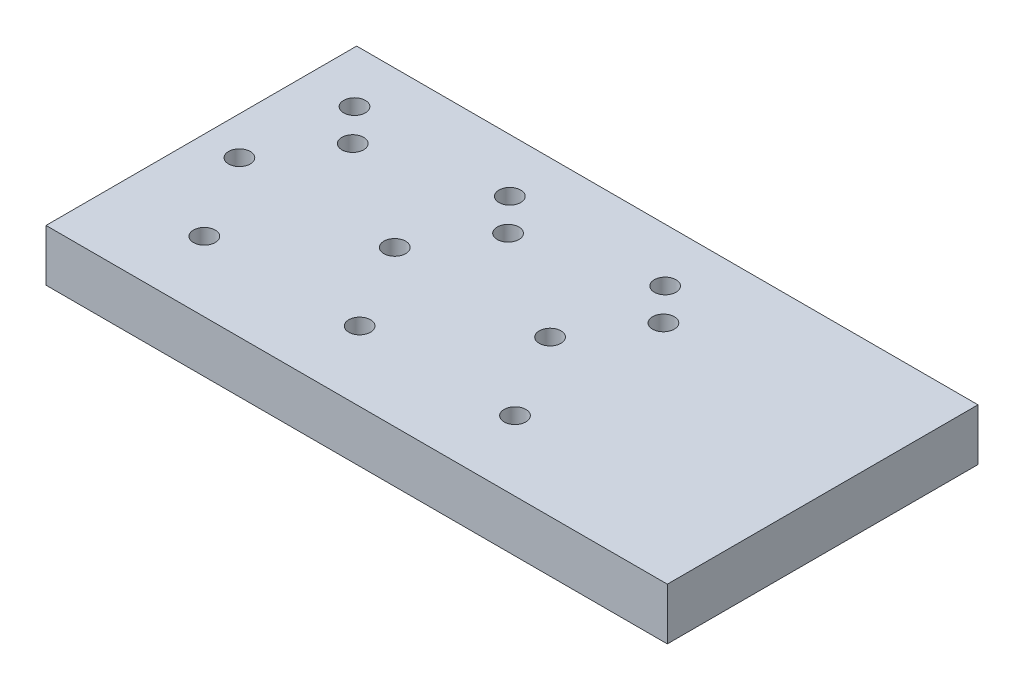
from build123d import *

# Parameters (mm, degrees)
SKIZZE1_W                     = 120
SKIZZE1_H                     = 60
LINEAR_AUSTRAGEN1_DEPTH       = 10
M5_GEWINDEBOHRUNG1_AT_2_COUNT = 2
M5_GEWINDEBOHRUNG1_AT_2_PITCH = 19.195077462
M5_GEWINDEBOHRUNG1_AT_3_COUNT = 2
M5_GEWINDEBOHRUNG1_AT_3_PITCH = 29.867760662
M5_GEWINDEBOHRUNG1_AT_4_COUNT = 2
M5_GEWINDEBOHRUNG1_AT_4_PITCH = 36.900091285
LINEARES_MUSTER1_COUNT        = 3
LINEARES_MUSTER1_PITCH        = 30


with BuildPart() as part:
    # Skizze1 → Linear austragen1 (new body)
    with BuildSketch(Plane(origin=(0, 0, 0), x_dir=(1, 0, 0), z_dir=(0, 1, 0))):
        Rectangle(SKIZZE1_W, SKIZZE1_H)
    extrude(amount=LINEAR_AUSTRAGEN1_DEPTH)

    # Skizze2 → M5 Gewindebohrung1 (revolve, cut)
    with BuildSketch(Plane(origin=(-42.891313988, 10, 16.53171986), x_dir=(0, 0, 1), z_dir=(1, 0, 0))):
        Polygon((0, 0), (0, 15.2618073), (2.1, 14), (2.1, 0), align=None)
    m5_gewindebohrung1 = revolve(axis=Axis((-42.891313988, 16.35, 16.53171986), (0, -1, 0)), mode=Mode.SUBTRACT)

    # M5 Gewindebohrung1 at 2: M5 Gewindebohrung1 ×2
    with Locations(*[Vector(-0.5081850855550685, 0, -0.8612478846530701) * (i * M5_GEWINDEBOHRUNG1_AT_2_PITCH) for i in range(1, M5_GEWINDEBOHRUNG1_AT_2_COUNT)]):
        add(m5_gewindebohrung1, mode=Mode.SUBTRACT)

    # M5 Gewindebohrung1 at 3: M5 Gewindebohrung1 ×2
    with Locations(*[Vector(-0.03944395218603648, 0, -0.9992217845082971) * (i * M5_GEWINDEBOHRUNG1_AT_3_PITCH) for i in range(1, M5_GEWINDEBOHRUNG1_AT_3_COUNT)]):
        add(m5_gewindebohrung1, mode=Mode.SUBTRACT)

    # M5 Gewindebohrung1 at 4: M5 Gewindebohrung1 ×2
    with Locations(*[Vector(-0.19484865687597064, 0, -0.9808333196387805) * (i * M5_GEWINDEBOHRUNG1_AT_4_PITCH) for i in range(1, M5_GEWINDEBOHRUNG1_AT_4_COUNT)]):
        add(m5_gewindebohrung1, mode=Mode.SUBTRACT)

    # Lineares Muster1: M5 Gewindebohrung1 ×3
    with Locations(*[(i * LINEARES_MUSTER1_PITCH, 0, 0) for i in range(1, LINEARES_MUSTER1_COUNT)]):
        add(m5_gewindebohrung1, mode=Mode.SUBTRACT)

    # Lineares Muster1 copy 1 sketch → Lineares Muster1 copy 1 (revolve, cut)
    with BuildSketch(Plane(origin=(-22.64596607, 10, 0), x_dir=(0, 0, 1), z_dir=(1, 0, 0))):
        Polygon((0, 0), (0, 15.2618073), (2.1, 14), (2.1, 0), align=None)
    revolve(axis=Axis((-22.64596607, 16.35, 0), (0, -1, 0)), mode=Mode.SUBTRACT)

    # Lineares Muster1 copy 2 sketch → Lineares Muster1 copy 2 (revolve, cut)
    with BuildSketch(Plane(origin=(7.35403393, 10, 0), x_dir=(0, 0, 1), z_dir=(1, 0, 0))):
        Polygon((0, 0), (0, 15.2618073), (2.1, 14), (2.1, 0), align=None)
    revolve(axis=Axis((7.35403393, 16.35, 0), (0, -1, 0)), mode=Mode.SUBTRACT)

    # Lineares Muster1 copy 3 sketch → Lineares Muster1 copy 3 (revolve, cut)
    with BuildSketch(Plane(origin=(-14.069416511, 10, -13.312797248), x_dir=(0, 0, 1), z_dir=(1, 0, 0))):
        Polygon((0, 0), (0, 15.2618073), (2.1, 14), (2.1, 0), align=None)
    revolve(axis=Axis((-14.069416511, 16.35, -13.312797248), (0, -1, 0)), mode=Mode.SUBTRACT)

    # Lineares Muster1 copy 4 sketch → Lineares Muster1 copy 4 (revolve, cut)
    with BuildSketch(Plane(origin=(15.930583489, 10, -13.312797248), x_dir=(0, 0, 1), z_dir=(1, 0, 0))):
        Polygon((0, 0), (0, 15.2618073), (2.1, 14), (2.1, 0), align=None)
    revolve(axis=Axis((15.930583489, 16.35, -13.312797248), (0, -1, 0)), mode=Mode.SUBTRACT)

    # Lineares Muster1 copy 5 sketch → Lineares Muster1 copy 5 (revolve, cut)
    with BuildSketch(Plane(origin=(-20.081247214, 10, -19.661119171), x_dir=(0, 0, 1), z_dir=(1, 0, 0))):
        Polygon((0, 0), (0, 15.2618073), (2.1, 14), (2.1, 0), align=None)
    revolve(axis=Axis((-20.081247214, 16.35, -19.661119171), (0, -1, 0)), mode=Mode.SUBTRACT)

    # Lineares Muster1 copy 6 sketch → Lineares Muster1 copy 6 (revolve, cut)
    with BuildSketch(Plane(origin=(9.918752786, 10, -19.661119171), x_dir=(0, 0, 1), z_dir=(1, 0, 0))):
        Polygon((0, 0), (0, 15.2618073), (2.1, 14), (2.1, 0), align=None)
    revolve(axis=Axis((9.918752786, 16.35, -19.661119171), (0, -1, 0)), mode=Mode.SUBTRACT)


solid = part.part
